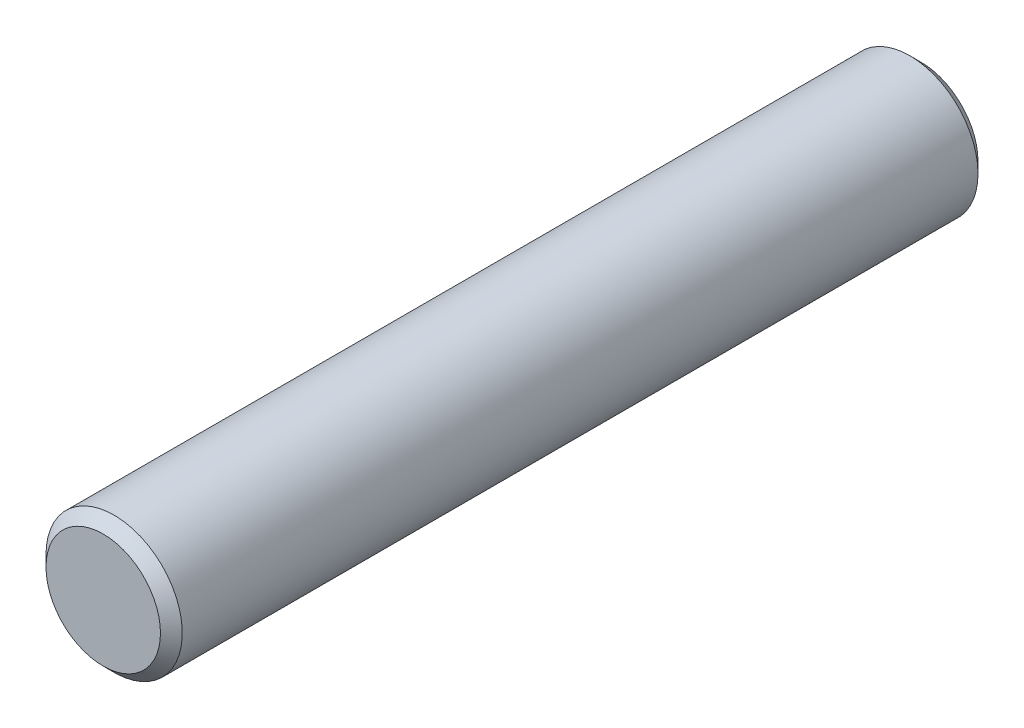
ISO-10303-21;
HEADER;
FILE_DESCRIPTION(('STEP AP214'),'2;1');
FILE_NAME('part.step','',(''),(''),'','','');
FILE_SCHEMA(('AUTOMOTIVE_DESIGN { 1 0 10303 214 1 1 1 1 }'));
ENDSEC;
DATA;
#1=APPLICATION_CONTEXT('core data for automotive mechanical design processes');
#2=APPLICATION_PROTOCOL_DEFINITION('international standard','automotive_design',2000,#1);
#3=PRODUCT_CONTEXT('',#1,'mechanical');
#4=PRODUCT('Part','Part','',(#3));
#5=PRODUCT_RELATED_PRODUCT_CATEGORY('part','',(#4));
#6=PRODUCT_DEFINITION_FORMATION('','',#4);
#7=PRODUCT_DEFINITION_CONTEXT('part definition',#1,'design');
#8=PRODUCT_DEFINITION('design','',#6,#7);
#9=PRODUCT_DEFINITION_SHAPE('','',#8);
#10=(LENGTH_UNIT() NAMED_UNIT(*) SI_UNIT(.MILLI.,.METRE.));
#11=(NAMED_UNIT(*) PLANE_ANGLE_UNIT() SI_UNIT($,.RADIAN.));
#12=(NAMED_UNIT(*) SI_UNIT($,.STERADIAN.) SOLID_ANGLE_UNIT());
#13=UNCERTAINTY_MEASURE_WITH_UNIT(LENGTH_MEASURE(1.E-05),#10,'distance_accuracy_value','');
#14=(GEOMETRIC_REPRESENTATION_CONTEXT(3) GLOBAL_UNCERTAINTY_ASSIGNED_CONTEXT((#13)) GLOBAL_UNIT_ASSIGNED_CONTEXT((#10,
#11,#12)) REPRESENTATION_CONTEXT('',''));
#15=CARTESIAN_POINT('',(0.,0.,0.));
#16=DIRECTION('',(0.,0.,1.));
#17=DIRECTION('',(1.,0.,0.));
#18=AXIS2_PLACEMENT_3D('',#15,#16,#17);
#19=CARTESIAN_POINT('',(0.,0.,9.525));
#20=DIRECTION('',(0.,0.,-1.));
#21=DIRECTION('',(-1.,0.,0.));
#22=AXIS2_PLACEMENT_3D('',#19,#20,#21);
#23=CYLINDRICAL_SURFACE('',#22,0.79375);
#24=CARTESIAN_POINT('',(0.,0.,0.127000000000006));
#25=DIRECTION('',(0.,0.,1.));
#26=DIRECTION('',(1.,0.,0.));
#27=AXIS2_PLACEMENT_3D('',#24,#25,#26);
#28=CIRCLE('',#27,0.79375);
#29=CARTESIAN_POINT('',(-0.79375,0.,0.127000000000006));
#30=VERTEX_POINT('',#29);
#31=EDGE_CURVE('E40',#30,#30,#28,.T.);
#32=CARTESIAN_POINT('',(0.,0.,9.398));
#33=DIRECTION('',(0.,0.,1.));
#34=DIRECTION('',(1.,0.,0.));
#35=AXIS2_PLACEMENT_3D('',#32,#33,#34);
#36=CIRCLE('',#35,0.79375);
#37=CARTESIAN_POINT('',(-0.79375,0.,9.398));
#38=VERTEX_POINT('',#37);
#39=EDGE_CURVE('E44',#38,#38,#36,.F.);
#40=CARTESIAN_POINT('',(-0.79375,0.,0.127000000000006));
#41=CARTESIAN_POINT('',(-0.79375,0.,0.223572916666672));
#42=CARTESIAN_POINT('',(-0.79375,0.,0.320145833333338));
#43=CARTESIAN_POINT('',(-0.79375,0.,0.513291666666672));
#44=CARTESIAN_POINT('',(-0.79375,0.,0.609864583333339));
#45=CARTESIAN_POINT('',(-0.79375,0.,0.803010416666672));
#46=CARTESIAN_POINT('',(-0.79375,0.,0.899583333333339));
#47=CARTESIAN_POINT('',(-0.79375,0.,1.09272916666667));
#48=CARTESIAN_POINT('',(-0.79375,0.,1.18930208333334));
#49=CARTESIAN_POINT('',(-0.79375,0.,1.38244791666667));
#50=CARTESIAN_POINT('',(-0.79375,0.,1.47902083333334));
#51=CARTESIAN_POINT('',(-0.79375,0.,1.67216666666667));
#52=CARTESIAN_POINT('',(-0.79375,0.,1.76873958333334));
#53=CARTESIAN_POINT('',(-0.79375,0.,1.96188541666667));
#54=CARTESIAN_POINT('',(-0.79375,0.,2.05845833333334));
#55=CARTESIAN_POINT('',(-0.79375,0.,2.25160416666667));
#56=CARTESIAN_POINT('',(-0.79375,0.,2.34817708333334));
#57=CARTESIAN_POINT('',(-0.79375,0.,2.54132291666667));
#58=CARTESIAN_POINT('',(-0.79375,0.,2.63789583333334));
#59=CARTESIAN_POINT('',(-0.79375,0.,2.83104166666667));
#60=CARTESIAN_POINT('',(-0.79375,0.,2.92761458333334));
#61=CARTESIAN_POINT('',(-0.79375,0.,3.12076041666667));
#62=CARTESIAN_POINT('',(-0.79375,0.,3.21733333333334));
#63=CARTESIAN_POINT('',(-0.79375,0.,3.41047916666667));
#64=CARTESIAN_POINT('',(-0.79375,0.,3.50705208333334));
#65=CARTESIAN_POINT('',(-0.79375,0.,3.70019791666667));
#66=CARTESIAN_POINT('',(-0.79375,0.,3.79677083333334));
#67=CARTESIAN_POINT('',(-0.79375,0.,3.98991666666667));
#68=CARTESIAN_POINT('',(-0.79375,0.,4.08648958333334));
#69=CARTESIAN_POINT('',(-0.79375,0.,4.27963541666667));
#70=CARTESIAN_POINT('',(-0.79375,0.,4.37620833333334));
#71=CARTESIAN_POINT('',(-0.79375,0.,4.56935416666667));
#72=CARTESIAN_POINT('',(-0.79375,0.,4.66592708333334));
#73=CARTESIAN_POINT('',(-0.79375,0.,4.85907291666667));
#74=CARTESIAN_POINT('',(-0.79375,0.,4.95564583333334));
#75=CARTESIAN_POINT('',(-0.79375,0.,5.14879166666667));
#76=CARTESIAN_POINT('',(-0.79375,0.,5.24536458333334));
#77=CARTESIAN_POINT('',(-0.79375,0.,5.43851041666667));
#78=CARTESIAN_POINT('',(-0.79375,0.,5.53508333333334));
#79=CARTESIAN_POINT('',(-0.79375,0.,5.72822916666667));
#80=CARTESIAN_POINT('',(-0.79375,0.,5.82480208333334));
#81=CARTESIAN_POINT('',(-0.79375,0.,6.01794791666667));
#82=CARTESIAN_POINT('',(-0.79375,0.,6.11452083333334));
#83=CARTESIAN_POINT('',(-0.79375,0.,6.30766666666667));
#84=CARTESIAN_POINT('',(-0.79375,0.,6.40423958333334));
#85=CARTESIAN_POINT('',(-0.79375,0.,6.59738541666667));
#86=CARTESIAN_POINT('',(-0.79375,0.,6.69395833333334));
#87=CARTESIAN_POINT('',(-0.79375,0.,6.88710416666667));
#88=CARTESIAN_POINT('',(-0.79375,0.,6.98367708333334));
#89=CARTESIAN_POINT('',(-0.79375,0.,7.17682291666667));
#90=CARTESIAN_POINT('',(-0.79375,0.,7.27339583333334));
#91=CARTESIAN_POINT('',(-0.79375,0.,7.46654166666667));
#92=CARTESIAN_POINT('',(-0.79375,0.,7.56311458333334));
#93=CARTESIAN_POINT('',(-0.79375,0.,7.75626041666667));
#94=CARTESIAN_POINT('',(-0.79375,0.,7.85283333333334));
#95=CARTESIAN_POINT('',(-0.79375,0.,8.04597916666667));
#96=CARTESIAN_POINT('',(-0.79375,0.,8.14255208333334));
#97=CARTESIAN_POINT('',(-0.79375,0.,8.33569791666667));
#98=CARTESIAN_POINT('',(-0.79375,0.,8.43227083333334));
#99=CARTESIAN_POINT('',(-0.79375,0.,8.62541666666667));
#100=CARTESIAN_POINT('',(-0.79375,0.,8.72198958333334));
#101=CARTESIAN_POINT('',(-0.79375,0.,8.91513541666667));
#102=CARTESIAN_POINT('',(-0.79375,0.,9.01170833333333));
#103=CARTESIAN_POINT('',(-0.79375,0.,9.20485416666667));
#104=CARTESIAN_POINT('',(-0.79375,0.,9.30142708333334));
#105=CARTESIAN_POINT('',(-0.79375,0.,9.398));
#106=B_SPLINE_CURVE_WITH_KNOTS('',3,(#40,#41,#42,#43,#44,#45,#46,#47,#48,#49,#50,#51,#52,#53,
#54,#55,#56,#57,#58,#59,#60,#61,#62,#63,#64,#65,#66,#67,#68,#69,#70,#71,#72,#73,#74,#75,#76,#77,
#78,#79,#80,#81,#82,#83,#84,#85,#86,#87,#88,#89,#90,#91,#92,#93,#94,#95,#96,#97,#98,#99,#100,
#101,#102,#103,#104,#105),.UNSPECIFIED.,.F.,.F.,(4,2,2,2,2,2,2,2,2,2,2,2,2,2,2,2,2,2,2,2,2,2,2,
2,2,2,2,2,2,2,2,2,4),(0.,0.289718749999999,0.5794375,0.869156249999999,1.158875,1.44859375,
1.7383125,2.02803125,2.31775,2.60746875,2.8971875,3.18690625,3.476625,3.76634375,4.0560625,
4.34578125,4.6355,4.92521875,5.2149375,5.50465625,5.794375,6.08409375,6.3738125,6.66353125,
6.95325,7.24296875,7.5326875,7.82240625,8.112125,8.40184375,8.6915625,8.98128125,9.271),.UNSPECIFIED.);
#107=EDGE_CURVE('BSEAM29',#30,#38,#106,.T.);
#108=ORIENTED_EDGE('',*,*,#31,.T.);
#109=ORIENTED_EDGE('',*,*,#39,.T.);
#110=ORIENTED_EDGE('',*,*,#107,.T.);
#111=ORIENTED_EDGE('',*,*,#107,.F.);
#112=EDGE_LOOP('',(#108,#110,#109,#111));
#113=FACE_BOUND('',#112,.T.);
#114=ADVANCED_FACE('F29',(#113),#23,.T.);
#115=CARTESIAN_POINT('',(0.,0.,9.525));
#116=DIRECTION('',(0.,0.,1.));
#117=DIRECTION('',(1.,0.,0.));
#118=AXIS2_PLACEMENT_3D('',#115,#116,#117);
#119=PLANE('',#118);
#120=CARTESIAN_POINT('',(0.,0.,9.525));
#121=DIRECTION('',(0.,0.,1.));
#122=DIRECTION('',(1.,0.,0.));
#123=AXIS2_PLACEMENT_3D('',#120,#121,#122);
#124=CIRCLE('',#123,0.666750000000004);
#125=CARTESIAN_POINT('',(0.666750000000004,0.,9.525));
#126=VERTEX_POINT('',#125);
#127=EDGE_CURVE('E10',#126,#126,#124,.T.);
#128=ORIENTED_EDGE('',*,*,#127,.T.);
#129=EDGE_LOOP('',(#128));
#130=FACE_BOUND('',#129,.T.);
#131=ADVANCED_FACE('F60',(#130),#119,.T.);
#132=CARTESIAN_POINT('',(0.,0.,0.));
#133=DIRECTION('',(0.,0.,1.));
#134=DIRECTION('',(1.,0.,0.));
#135=AXIS2_PLACEMENT_3D('',#132,#133,#134);
#136=PLANE('',#135);
#137=CARTESIAN_POINT('',(0.,0.,0.));
#138=DIRECTION('',(0.,0.,1.));
#139=DIRECTION('',(1.,0.,0.));
#140=AXIS2_PLACEMENT_3D('',#137,#138,#139);
#141=CIRCLE('',#140,0.666749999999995);
#142=CARTESIAN_POINT('',(0.666749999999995,0.,0.));
#143=VERTEX_POINT('',#142);
#144=EDGE_CURVE('E36',#143,#143,#141,.F.);
#145=ORIENTED_EDGE('',*,*,#144,.T.);
#146=EDGE_LOOP('',(#145));
#147=FACE_BOUND('',#146,.T.);
#148=ADVANCED_FACE('F57',(#147),#136,.F.);
#149=CARTESIAN_POINT('',(0.,0.,0.127000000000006));
#150=DIRECTION('',(0.,0.,1.));
#151=DIRECTION('',(1.,0.,0.));
#152=AXIS2_PLACEMENT_3D('',#149,#150,#151);
#153=CONICAL_SURFACE('',#152,0.79375,0.785398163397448);
#154=ORIENTED_EDGE('',*,*,#144,.F.);
#155=EDGE_LOOP('',(#154));
#156=FACE_BOUND('',#155,.T.);
#157=ORIENTED_EDGE('',*,*,#31,.F.);
#158=EDGE_LOOP('',(#157));
#159=FACE_BOUND('',#158,.T.);
#160=ADVANCED_FACE('F53',(#156,#159),#153,.T.);
#161=CARTESIAN_POINT('',(0.,0.,9.525));
#162=DIRECTION('',(0.,0.,-1.));
#163=DIRECTION('',(-1.,0.,0.));
#164=AXIS2_PLACEMENT_3D('',#161,#162,#163);
#165=CONICAL_SURFACE('',#164,0.666750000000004,0.785398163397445);
#166=ORIENTED_EDGE('',*,*,#39,.F.);
#167=EDGE_LOOP('',(#166));
#168=FACE_BOUND('',#167,.T.);
#169=ORIENTED_EDGE('',*,*,#127,.F.);
#170=EDGE_LOOP('',(#169));
#171=FACE_BOUND('',#170,.T.);
#172=ADVANCED_FACE('F31',(#168,#171),#165,.T.);
#173=CLOSED_SHELL('',(#114,#131,#148,#160,#172));
#174=MANIFOLD_SOLID_BREP('B2',#173);
#175=ADVANCED_BREP_SHAPE_REPRESENTATION('',(#18,#174),#14);
#176=SHAPE_DEFINITION_REPRESENTATION(#9,#175);
ENDSEC;
END-ISO-10303-21;
